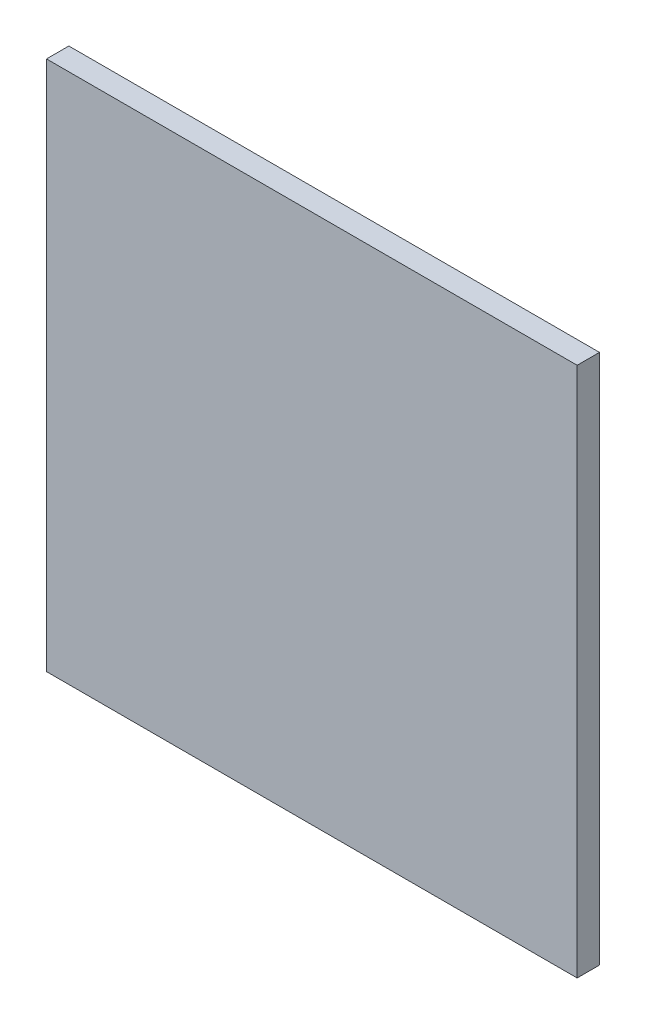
from build123d import *

# Parameters (mm, degrees)
ESQUISSE1_W      = 19
ESQUISSE1_H      = 19
EXTRUSION1_DEPTH = 0.8


with BuildPart() as part:
    # Esquisse1 → Extrusion1 (new body)
    with BuildSketch(Plane.XY):
        with Locations((9.5, 9.5)):
            Rectangle(ESQUISSE1_W, ESQUISSE1_H)
    extrude(amount=EXTRUSION1_DEPTH)


solid = part.part
